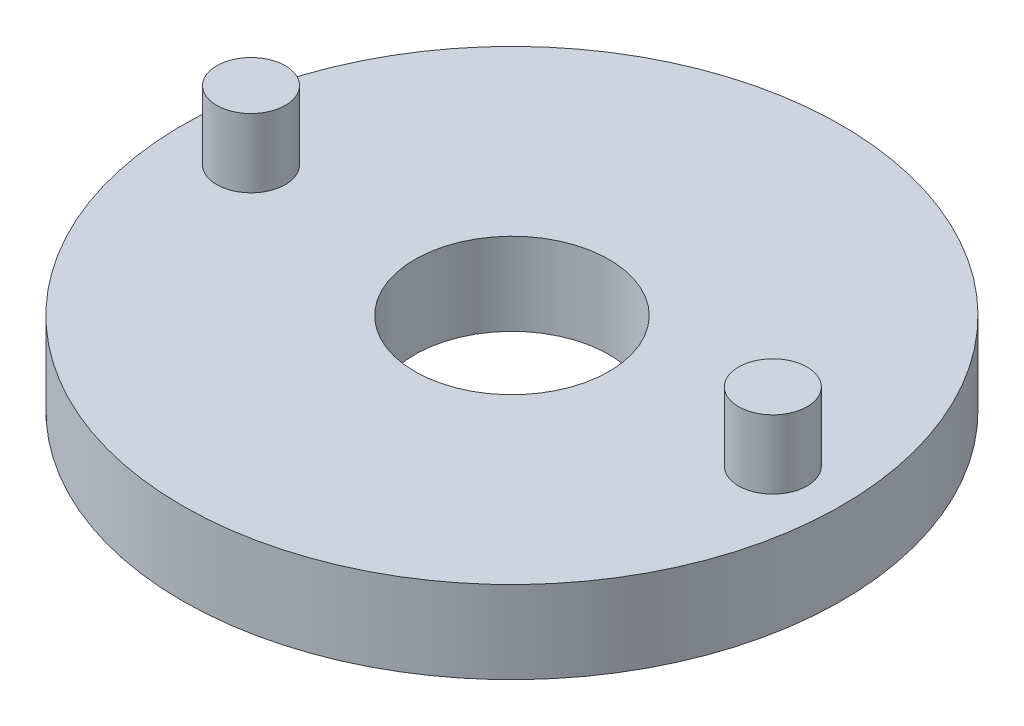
ISO-10303-21;
HEADER;
FILE_DESCRIPTION(('STEP AP214'),'2;1');
FILE_NAME('part.step','',(''),(''),'','','');
FILE_SCHEMA(('AUTOMOTIVE_DESIGN { 1 0 10303 214 1 1 1 1 }'));
ENDSEC;
DATA;
#1=APPLICATION_CONTEXT('core data for automotive mechanical design processes');
#2=APPLICATION_PROTOCOL_DEFINITION('international standard','automotive_design',2000,#1);
#3=PRODUCT_CONTEXT('',#1,'mechanical');
#4=PRODUCT('Part','Part','',(#3));
#5=PRODUCT_RELATED_PRODUCT_CATEGORY('part','',(#4));
#6=PRODUCT_DEFINITION_FORMATION('','',#4);
#7=PRODUCT_DEFINITION_CONTEXT('part definition',#1,'design');
#8=PRODUCT_DEFINITION('design','',#6,#7);
#9=PRODUCT_DEFINITION_SHAPE('','',#8);
#10=(LENGTH_UNIT() NAMED_UNIT(*) SI_UNIT(.MILLI.,.METRE.));
#11=(NAMED_UNIT(*) PLANE_ANGLE_UNIT() SI_UNIT($,.RADIAN.));
#12=(NAMED_UNIT(*) SI_UNIT($,.STERADIAN.) SOLID_ANGLE_UNIT());
#13=UNCERTAINTY_MEASURE_WITH_UNIT(LENGTH_MEASURE(1.E-05),#10,'distance_accuracy_value','');
#14=(GEOMETRIC_REPRESENTATION_CONTEXT(3) GLOBAL_UNCERTAINTY_ASSIGNED_CONTEXT((#13)) GLOBAL_UNIT_ASSIGNED_CONTEXT((#10,
#11,#12)) REPRESENTATION_CONTEXT('',''));
#15=CARTESIAN_POINT('',(0.,0.,0.));
#16=DIRECTION('',(0.,0.,1.));
#17=DIRECTION('',(1.,0.,0.));
#18=AXIS2_PLACEMENT_3D('',#15,#16,#17);
#19=CARTESIAN_POINT('',(0.,0.,0.));
#20=DIRECTION('',(0.,1.,0.));
#21=DIRECTION('',(0.,0.,1.));
#22=AXIS2_PLACEMENT_3D('',#19,#20,#21);
#23=PLANE('',#22);
#24=CARTESIAN_POINT('',(0.,0.,0.));
#25=DIRECTION('',(0.,1.,0.));
#26=DIRECTION('',(0.,0.,1.));
#27=AXIS2_PLACEMENT_3D('',#24,#25,#26);
#28=CIRCLE('',#27,7.07106781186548);
#29=CARTESIAN_POINT('',(0.,0.,7.07106781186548));
#30=VERTEX_POINT('',#29);
#31=EDGE_CURVE('E42',#30,#30,#28,.T.);
#32=ORIENTED_EDGE('',*,*,#31,.T.);
#33=EDGE_LOOP('',(#32));
#34=FACE_BOUND('',#33,.T.);
#35=CARTESIAN_POINT('',(0.,0.,0.));
#36=DIRECTION('',(0.,-1.,0.));
#37=DIRECTION('',(0.,0.,-1.));
#38=AXIS2_PLACEMENT_3D('',#35,#36,#37);
#39=CIRCLE('',#38,10.5);
#40=CARTESIAN_POINT('',(0.,0.,-10.5));
#41=VERTEX_POINT('',#40);
#42=EDGE_CURVE('E68',#41,#41,#39,.T.);
#43=ORIENTED_EDGE('',*,*,#42,.T.);
#44=EDGE_LOOP('',(#43));
#45=FACE_BOUND('',#44,.T.);
#46=ADVANCED_FACE('F31',(#34,#45),#23,.F.);
#47=CARTESIAN_POINT('',(0.,6.,0.));
#48=DIRECTION('',(0.,-1.,0.));
#49=DIRECTION('',(0.,0.,-1.));
#50=AXIS2_PLACEMENT_3D('',#47,#48,#49);
#51=CYLINDRICAL_SURFACE('',#50,24.);
#52=CARTESIAN_POINT('',(0.,6.,0.));
#53=DIRECTION('',(0.,1.,0.));
#54=DIRECTION('',(0.,0.,1.));
#55=AXIS2_PLACEMENT_3D('',#52,#53,#54);
#56=CIRCLE('',#55,24.);
#57=CARTESIAN_POINT('',(0.,6.,24.));
#58=VERTEX_POINT('',#57);
#59=EDGE_CURVE('E10',#58,#58,#56,.T.);
#60=ORIENTED_EDGE('',*,*,#59,.F.);
#61=EDGE_LOOP('',(#60));
#62=FACE_BOUND('',#61,.T.);
#63=CARTESIAN_POINT('',(0.,0.,0.));
#64=DIRECTION('',(0.,1.,0.));
#65=DIRECTION('',(0.,0.,1.));
#66=AXIS2_PLACEMENT_3D('',#63,#64,#65);
#67=CIRCLE('',#66,24.);
#68=CARTESIAN_POINT('',(0.,0.,24.));
#69=VERTEX_POINT('',#68);
#70=EDGE_CURVE('E35',#69,#69,#67,.T.);
#71=ORIENTED_EDGE('',*,*,#70,.T.);
#72=EDGE_LOOP('',(#71));
#73=FACE_BOUND('',#72,.T.);
#74=ADVANCED_FACE('F33',(#62,#73),#51,.T.);
#75=CARTESIAN_POINT('',(0.,6.,0.));
#76=DIRECTION('',(0.,1.,0.));
#77=DIRECTION('',(0.,0.,1.));
#78=AXIS2_PLACEMENT_3D('',#75,#76,#77);
#79=PLANE('',#78);
#80=CARTESIAN_POINT('',(19.,6.,1.32676290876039E-13));
#81=DIRECTION('',(0.,1.,0.));
#82=DIRECTION('',(0.,0.,1.));
#83=AXIS2_PLACEMENT_3D('',#80,#81,#82);
#84=CIRCLE('',#83,2.5);
#85=CARTESIAN_POINT('',(19.,6.,2.50000000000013));
#86=VERTEX_POINT('',#85);
#87=EDGE_CURVE('E56',#86,#86,#84,.T.);
#88=ORIENTED_EDGE('',*,*,#87,.F.);
#89=EDGE_LOOP('',(#88));
#90=FACE_BOUND('',#89,.T.);
#91=CARTESIAN_POINT('',(-19.,6.,0.));
#92=DIRECTION('',(0.,1.,0.));
#93=DIRECTION('',(0.,0.,1.));
#94=AXIS2_PLACEMENT_3D('',#91,#92,#93);
#95=CIRCLE('',#94,2.5);
#96=CARTESIAN_POINT('',(-19.,6.,2.5));
#97=VERTEX_POINT('',#96);
#98=EDGE_CURVE('E50',#97,#97,#95,.T.);
#99=ORIENTED_EDGE('',*,*,#98,.F.);
#100=EDGE_LOOP('',(#99));
#101=FACE_BOUND('',#100,.T.);
#102=CARTESIAN_POINT('',(0.,6.,0.));
#103=DIRECTION('',(0.,1.,0.));
#104=DIRECTION('',(0.,0.,1.));
#105=AXIS2_PLACEMENT_3D('',#102,#103,#104);
#106=CIRCLE('',#105,7.07106781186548);
#107=CARTESIAN_POINT('',(0.,6.,7.07106781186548));
#108=VERTEX_POINT('',#107);
#109=EDGE_CURVE('E44',#108,#108,#106,.T.);
#110=ORIENTED_EDGE('',*,*,#109,.F.);
#111=EDGE_LOOP('',(#110));
#112=FACE_BOUND('',#111,.T.);
#113=ORIENTED_EDGE('',*,*,#59,.T.);
#114=EDGE_LOOP('',(#113));
#115=FACE_BOUND('',#114,.T.);
#116=ADVANCED_FACE('F94',(#90,#101,#112,#115),#79,.T.);
#117=CARTESIAN_POINT('',(0.,0.,0.));
#118=DIRECTION('',(0.,-1.,0.));
#119=DIRECTION('',(0.,0.,-1.));
#120=AXIS2_PLACEMENT_3D('',#117,#118,#119);
#121=CIRCLE('',#120,21.);
#122=CARTESIAN_POINT('',(0.,0.,-21.));
#123=VERTEX_POINT('',#122);
#124=EDGE_CURVE('E62',#123,#123,#121,.T.);
#125=ORIENTED_EDGE('',*,*,#124,.F.);
#126=EDGE_LOOP('',(#125));
#127=FACE_BOUND('',#126,.T.);
#128=ORIENTED_EDGE('',*,*,#70,.F.);
#129=EDGE_LOOP('',(#128));
#130=FACE_BOUND('',#129,.T.);
#131=ADVANCED_FACE('F90',(#127,#130),#23,.F.);
#132=CARTESIAN_POINT('',(0.,0.,0.));
#133=DIRECTION('',(0.,1.,0.));
#134=DIRECTION('',(0.,0.,1.));
#135=AXIS2_PLACEMENT_3D('',#132,#133,#134);
#136=CYLINDRICAL_SURFACE('',#135,7.07106781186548);
#137=ORIENTED_EDGE('',*,*,#31,.F.);
#138=EDGE_LOOP('',(#137));
#139=FACE_BOUND('',#138,.T.);
#140=ORIENTED_EDGE('',*,*,#109,.T.);
#141=EDGE_LOOP('',(#140));
#142=FACE_BOUND('',#141,.T.);
#143=ADVANCED_FACE('F93',(#139,#142),#136,.F.);
#144=CARTESIAN_POINT('',(-19.,11.,0.));
#145=DIRECTION('',(0.,-1.,0.));
#146=DIRECTION('',(0.,0.,-1.));
#147=AXIS2_PLACEMENT_3D('',#144,#145,#146);
#148=CYLINDRICAL_SURFACE('',#147,2.5);
#149=CARTESIAN_POINT('',(-19.,11.,0.));
#150=DIRECTION('',(0.,1.,0.));
#151=DIRECTION('',(0.,0.,1.));
#152=AXIS2_PLACEMENT_3D('',#149,#150,#151);
#153=CIRCLE('',#152,2.5);
#154=CARTESIAN_POINT('',(-19.,11.,2.5));
#155=VERTEX_POINT('',#154);
#156=EDGE_CURVE('E47',#155,#155,#153,.T.);
#157=ORIENTED_EDGE('',*,*,#156,.F.);
#158=EDGE_LOOP('',(#157));
#159=FACE_BOUND('',#158,.T.);
#160=ORIENTED_EDGE('',*,*,#98,.T.);
#161=EDGE_LOOP('',(#160));
#162=FACE_BOUND('',#161,.T.);
#163=ADVANCED_FACE('F112',(#159,#162),#148,.T.);
#164=CARTESIAN_POINT('',(-19.,11.,0.));
#165=DIRECTION('',(0.,1.,0.));
#166=DIRECTION('',(0.,0.,1.));
#167=AXIS2_PLACEMENT_3D('',#164,#165,#166);
#168=PLANE('',#167);
#169=ORIENTED_EDGE('',*,*,#156,.T.);
#170=EDGE_LOOP('',(#169));
#171=FACE_BOUND('',#170,.T.);
#172=ADVANCED_FACE('F116',(#171),#168,.T.);
#173=CARTESIAN_POINT('',(19.,11.,1.32676290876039E-13));
#174=DIRECTION('',(0.,-1.,0.));
#175=DIRECTION('',(0.,0.,-1.));
#176=AXIS2_PLACEMENT_3D('',#173,#174,#175);
#177=CYLINDRICAL_SURFACE('',#176,2.5);
#178=CARTESIAN_POINT('',(19.,11.,1.32676290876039E-13));
#179=DIRECTION('',(0.,1.,0.));
#180=DIRECTION('',(0.,0.,1.));
#181=AXIS2_PLACEMENT_3D('',#178,#179,#180);
#182=CIRCLE('',#181,2.5);
#183=CARTESIAN_POINT('',(19.,11.,2.50000000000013));
#184=VERTEX_POINT('',#183);
#185=EDGE_CURVE('E53',#184,#184,#182,.T.);
#186=ORIENTED_EDGE('',*,*,#185,.F.);
#187=EDGE_LOOP('',(#186));
#188=FACE_BOUND('',#187,.T.);
#189=ORIENTED_EDGE('',*,*,#87,.T.);
#190=EDGE_LOOP('',(#189));
#191=FACE_BOUND('',#190,.T.);
#192=ADVANCED_FACE('F120',(#188,#191),#177,.T.);
#193=CARTESIAN_POINT('',(19.,11.,1.32676290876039E-13));
#194=DIRECTION('',(0.,1.,0.));
#195=DIRECTION('',(0.,0.,1.));
#196=AXIS2_PLACEMENT_3D('',#193,#194,#195);
#197=PLANE('',#196);
#198=ORIENTED_EDGE('',*,*,#185,.T.);
#199=EDGE_LOOP('',(#198));
#200=FACE_BOUND('',#199,.T.);
#201=ADVANCED_FACE('F86',(#200),#197,.T.);
#202=CARTESIAN_POINT('',(0.,4.,0.));
#203=DIRECTION('',(0.,-1.,0.));
#204=DIRECTION('',(0.,0.,-1.));
#205=AXIS2_PLACEMENT_3D('',#202,#203,#204);
#206=CYLINDRICAL_SURFACE('',#205,21.);
#207=CARTESIAN_POINT('',(0.,4.,0.));
#208=DIRECTION('',(0.,-1.,0.));
#209=DIRECTION('',(0.,0.,-1.));
#210=AXIS2_PLACEMENT_3D('',#207,#208,#209);
#211=CIRCLE('',#210,21.);
#212=CARTESIAN_POINT('',(0.,4.,-21.));
#213=VERTEX_POINT('',#212);
#214=EDGE_CURVE('E59',#213,#213,#211,.T.);
#215=ORIENTED_EDGE('',*,*,#214,.F.);
#216=EDGE_LOOP('',(#215));
#217=FACE_BOUND('',#216,.T.);
#218=ORIENTED_EDGE('',*,*,#124,.T.);
#219=EDGE_LOOP('',(#218));
#220=FACE_BOUND('',#219,.T.);
#221=ADVANCED_FACE('F80',(#217,#220),#206,.F.);
#222=CARTESIAN_POINT('',(0.,4.,0.));
#223=DIRECTION('',(0.,-1.,0.));
#224=DIRECTION('',(0.,0.,-1.));
#225=AXIS2_PLACEMENT_3D('',#222,#223,#224);
#226=PLANE('',#225);
#227=CARTESIAN_POINT('',(0.,4.,0.));
#228=DIRECTION('',(0.,-1.,0.));
#229=DIRECTION('',(0.,0.,-1.));
#230=AXIS2_PLACEMENT_3D('',#227,#228,#229);
#231=CIRCLE('',#230,10.5);
#232=CARTESIAN_POINT('',(0.,4.,-10.5));
#233=VERTEX_POINT('',#232);
#234=EDGE_CURVE('E65',#233,#233,#231,.T.);
#235=ORIENTED_EDGE('',*,*,#234,.F.);
#236=EDGE_LOOP('',(#235));
#237=FACE_BOUND('',#236,.T.);
#238=ORIENTED_EDGE('',*,*,#214,.T.);
#239=EDGE_LOOP('',(#238));
#240=FACE_BOUND('',#239,.T.);
#241=ADVANCED_FACE('F77',(#237,#240),#226,.T.);
#242=CARTESIAN_POINT('',(0.,4.,0.));
#243=DIRECTION('',(0.,-1.,0.));
#244=DIRECTION('',(0.,0.,-1.));
#245=AXIS2_PLACEMENT_3D('',#242,#243,#244);
#246=CYLINDRICAL_SURFACE('',#245,10.5);
#247=ORIENTED_EDGE('',*,*,#234,.T.);
#248=EDGE_LOOP('',(#247));
#249=FACE_BOUND('',#248,.T.);
#250=ORIENTED_EDGE('',*,*,#42,.F.);
#251=EDGE_LOOP('',(#250));
#252=FACE_BOUND('',#251,.T.);
#253=ADVANCED_FACE('F74',(#249,#252),#246,.T.);
#254=CLOSED_SHELL('',(#46,#74,#116,#131,#143,#163,#172,#192,#201,#221,#241,#253));
#255=MANIFOLD_SOLID_BREP('B2',#254);
#256=ADVANCED_BREP_SHAPE_REPRESENTATION('',(#18,#255),#14);
#257=SHAPE_DEFINITION_REPRESENTATION(#9,#256);
ENDSEC;
END-ISO-10303-21;
